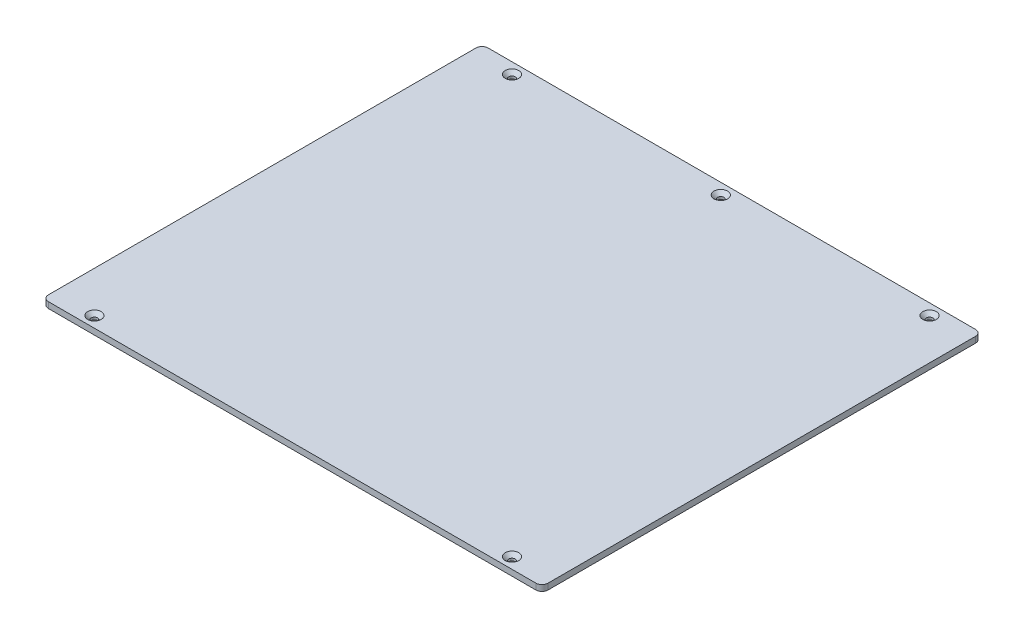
from build123d import *

# Parameters (mm, degrees)
CROQUIS1_W              = 250
CROQUIS1_H              = 220
CROQUIS1_R              = 1.6
SALIENTE_EXTRUIR2_DEPTH = 3
CHAMFER_1_SIZE          = 1.8
FILLET_1_R              = 3


with BuildPart() as part:
    # Croquis1 → Saliente-Extruir2 (new body)
    with BuildSketch(Plane(origin=(0, 0, 0), x_dir=(1, 0, 0), z_dir=(0, 1, 0))):
        Rectangle(CROQUIS1_W, CROQUIS1_H)
        with Locations(Location((104.5, 104.5, 0), (0, 0, 270))):
            Circle(CROQUIS1_R, mode=Mode.SUBTRACT)
        with Locations(Location((-104.5, 104.5, 0), (0, 0, 90))):
            Circle(CROQUIS1_R, mode=Mode.SUBTRACT)
        with Locations(Location((104.5, -104.5, 0), (0, 0, 90))):
            Circle(CROQUIS1_R, mode=Mode.SUBTRACT)
        with Locations(Location((-104.5, -104.5, 0), (0, 0, 270))):
            Circle(CROQUIS1_R, mode=Mode.SUBTRACT)
        with Locations(Location((0, 104.5, 0), (0, 0, 270))):
            Circle(CROQUIS1_R, mode=Mode.SUBTRACT)
    extrude(amount=SALIENTE_EXTRUIR2_DEPTH)

    # Chamfer 1
    chamfer_1_edges = [part.edges().sort_by_distance(p)[0] for p in [
        (104.5, 3, -106.1),
        (-104.5, 3, -102.9),
        (104.5, 3, 106.1),
        (-104.5, 3, 102.9),
        (0, 3, -106.1),
    ]]
    chamfer(chamfer_1_edges, length=CHAMFER_1_SIZE)

    # Fillet 1
    fillet_1_edges = [part.edges().sort_by_distance(p)[0] for p in [
        (125, 1.5, 110),
        (-125, 1.5, 110),
        (-125, 1.5, -110),
        (125, 1.5, -110),
    ]]
    fillet(fillet_1_edges, radius=FILLET_1_R)


solid = part.part
